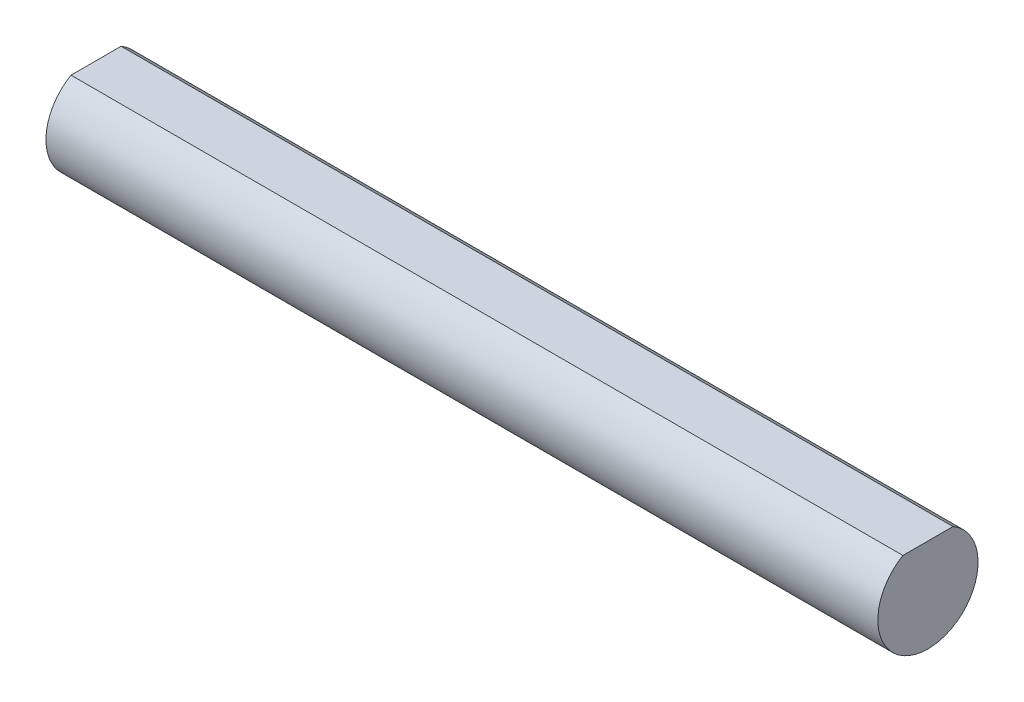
from build123d import *

# Parameters (mm, degrees)
BOSS_EXTRUDE1_DEPTH = 49.8


with BuildPart() as part:
    # Sketch1 → Boss-Extrude1 (new body)
    with BuildSketch(Plane(origin=(0, 0, 0), x_dir=(0, 0, -1), z_dir=(1, 0, 0))):
        with BuildLine():
            Line((1.5, 2.598076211), (-1.5, 2.598076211))
            ThreePointArc((-1.5, 2.598076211), (0, -3), (1.5, 2.598076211))
        make_face()
    extrude(amount=BOSS_EXTRUDE1_DEPTH)


solid = part.part
